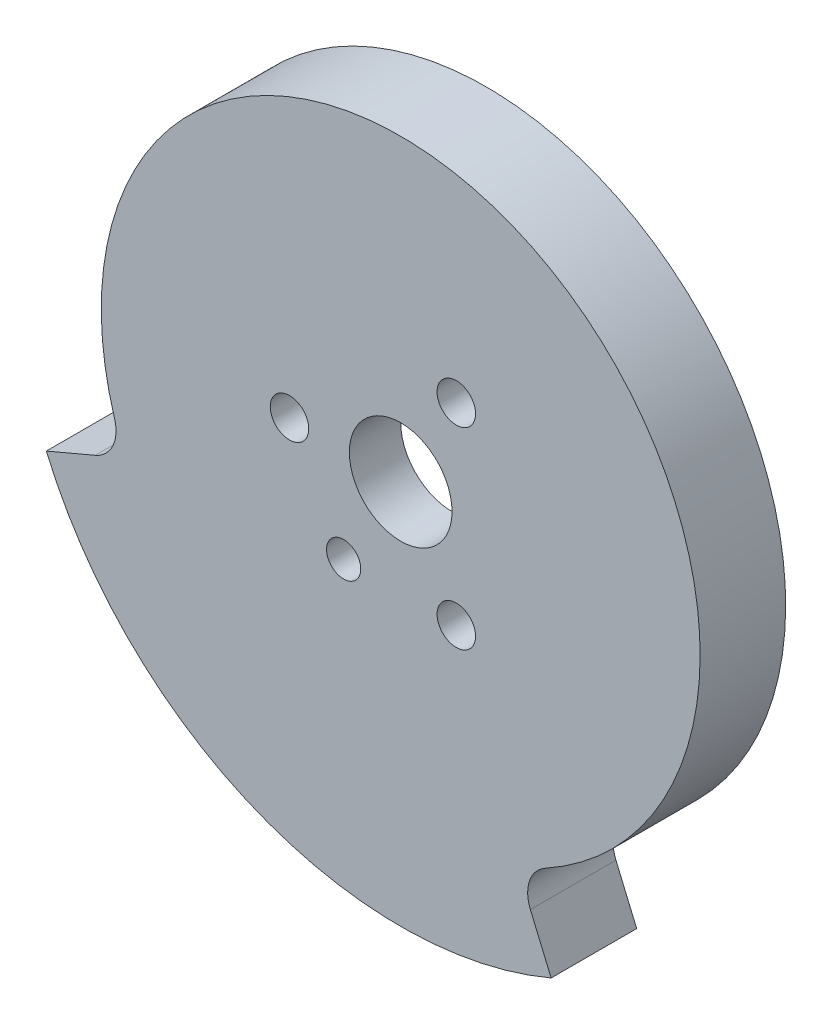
ISO-10303-21;
HEADER;
FILE_DESCRIPTION(('STEP AP214'),'2;1');
FILE_NAME('part.step','',(''),(''),'','','');
FILE_SCHEMA(('AUTOMOTIVE_DESIGN { 1 0 10303 214 1 1 1 1 }'));
ENDSEC;
DATA;
#1=APPLICATION_CONTEXT('core data for automotive mechanical design processes');
#2=APPLICATION_PROTOCOL_DEFINITION('international standard','automotive_design',2000,#1);
#3=PRODUCT_CONTEXT('',#1,'mechanical');
#4=PRODUCT('Part','Part','',(#3));
#5=PRODUCT_RELATED_PRODUCT_CATEGORY('part','',(#4));
#6=PRODUCT_DEFINITION_FORMATION('','',#4);
#7=PRODUCT_DEFINITION_CONTEXT('part definition',#1,'design');
#8=PRODUCT_DEFINITION('design','',#6,#7);
#9=PRODUCT_DEFINITION_SHAPE('','',#8);
#10=(LENGTH_UNIT() NAMED_UNIT(*) SI_UNIT(.MILLI.,.METRE.));
#11=(NAMED_UNIT(*) PLANE_ANGLE_UNIT() SI_UNIT($,.RADIAN.));
#12=(NAMED_UNIT(*) SI_UNIT($,.STERADIAN.) SOLID_ANGLE_UNIT());
#13=UNCERTAINTY_MEASURE_WITH_UNIT(LENGTH_MEASURE(1.E-05),#10,'distance_accuracy_value','');
#14=(GEOMETRIC_REPRESENTATION_CONTEXT(3) GLOBAL_UNCERTAINTY_ASSIGNED_CONTEXT((#13)) GLOBAL_UNIT_ASSIGNED_CONTEXT((#10,
#11,#12)) REPRESENTATION_CONTEXT('',''));
#15=CARTESIAN_POINT('',(0.,0.,0.));
#16=DIRECTION('',(0.,0.,1.));
#17=DIRECTION('',(1.,0.,0.));
#18=AXIS2_PLACEMENT_3D('',#15,#16,#17);
#19=CARTESIAN_POINT('',(-13.,0.,10.));
#20=DIRECTION('',(0.,0.,-1.));
#21=DIRECTION('',(-1.,0.,0.));
#22=AXIS2_PLACEMENT_3D('',#19,#20,#21);
#23=CYLINDRICAL_SURFACE('',#22,2.25);
#24=CARTESIAN_POINT('',(-13.,0.,10.));
#25=DIRECTION('',(0.,0.,1.));
#26=DIRECTION('',(1.,0.,0.));
#27=AXIS2_PLACEMENT_3D('',#24,#25,#26);
#28=CIRCLE('',#27,2.25);
#29=CARTESIAN_POINT('',(-10.75,0.,10.));
#30=VERTEX_POINT('',#29);
#31=EDGE_CURVE('E103',#30,#30,#28,.T.);
#32=ORIENTED_EDGE('',*,*,#31,.T.);
#33=EDGE_LOOP('',(#32));
#34=FACE_BOUND('',#33,.T.);
#35=CARTESIAN_POINT('',(-13.,0.,4.));
#36=DIRECTION('',(0.,0.,-1.));
#37=DIRECTION('',(-1.,0.,0.));
#38=AXIS2_PLACEMENT_3D('',#35,#36,#37);
#39=CIRCLE('',#38,2.25);
#40=CARTESIAN_POINT('',(-15.25,0.,4.));
#41=VERTEX_POINT('',#40);
#42=EDGE_CURVE('E201',#41,#41,#39,.T.);
#43=ORIENTED_EDGE('',*,*,#42,.T.);
#44=EDGE_LOOP('',(#43));
#45=FACE_BOUND('',#44,.T.);
#46=ADVANCED_FACE('F31',(#34,#45),#23,.F.);
#47=CARTESIAN_POINT('',(6.49999999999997,11.2583302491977,10.));
#48=DIRECTION('',(0.,0.,-1.));
#49=DIRECTION('',(-1.,0.,0.));
#50=AXIS2_PLACEMENT_3D('',#47,#48,#49);
#51=CYLINDRICAL_SURFACE('',#50,2.25);
#52=CARTESIAN_POINT('',(6.49999999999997,11.2583302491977,10.));
#53=DIRECTION('',(0.,0.,1.));
#54=DIRECTION('',(1.,0.,0.));
#55=AXIS2_PLACEMENT_3D('',#52,#53,#54);
#56=CIRCLE('',#55,2.25);
#57=CARTESIAN_POINT('',(8.74999999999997,11.2583302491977,10.));
#58=VERTEX_POINT('',#57);
#59=EDGE_CURVE('E106',#58,#58,#56,.T.);
#60=ORIENTED_EDGE('',*,*,#59,.T.);
#61=EDGE_LOOP('',(#60));
#62=FACE_BOUND('',#61,.T.);
#63=CARTESIAN_POINT('',(6.49999999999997,11.2583302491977,4.));
#64=DIRECTION('',(0.,0.,-1.));
#65=DIRECTION('',(-1.,0.,0.));
#66=AXIS2_PLACEMENT_3D('',#63,#64,#65);
#67=CIRCLE('',#66,2.25);
#68=CARTESIAN_POINT('',(4.24999999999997,11.2583302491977,4.));
#69=VERTEX_POINT('',#68);
#70=EDGE_CURVE('E204',#69,#69,#67,.T.);
#71=ORIENTED_EDGE('',*,*,#70,.T.);
#72=EDGE_LOOP('',(#71));
#73=FACE_BOUND('',#72,.T.);
#74=ADVANCED_FACE('F164',(#62,#73),#51,.F.);
#75=CARTESIAN_POINT('',(6.49999999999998,-11.2583302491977,10.));
#76=DIRECTION('',(0.,0.,-1.));
#77=DIRECTION('',(-1.,0.,0.));
#78=AXIS2_PLACEMENT_3D('',#75,#76,#77);
#79=CYLINDRICAL_SURFACE('',#78,2.25);
#80=CARTESIAN_POINT('',(6.49999999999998,-11.2583302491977,10.));
#81=DIRECTION('',(0.,0.,1.));
#82=DIRECTION('',(1.,0.,0.));
#83=AXIS2_PLACEMENT_3D('',#80,#81,#82);
#84=CIRCLE('',#83,2.25);
#85=CARTESIAN_POINT('',(8.74999999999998,-11.2583302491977,10.));
#86=VERTEX_POINT('',#85);
#87=EDGE_CURVE('E193',#86,#86,#84,.T.);
#88=ORIENTED_EDGE('',*,*,#87,.T.);
#89=EDGE_LOOP('',(#88));
#90=FACE_BOUND('',#89,.T.);
#91=CARTESIAN_POINT('',(6.49999999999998,-11.2583302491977,4.));
#92=DIRECTION('',(0.,0.,-1.));
#93=DIRECTION('',(-1.,0.,0.));
#94=AXIS2_PLACEMENT_3D('',#91,#92,#93);
#95=CIRCLE('',#94,2.25);
#96=CARTESIAN_POINT('',(4.24999999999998,-11.2583302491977,4.));
#97=VERTEX_POINT('',#96);
#98=EDGE_CURVE('E207',#97,#97,#95,.T.);
#99=ORIENTED_EDGE('',*,*,#98,.T.);
#100=EDGE_LOOP('',(#99));
#101=FACE_BOUND('',#100,.T.);
#102=ADVANCED_FACE('F170',(#90,#101),#79,.F.);
#103=CARTESIAN_POINT('',(0.,0.,10.));
#104=DIRECTION('',(0.,0.,-1.));
#105=DIRECTION('',(-1.,0.,0.));
#106=AXIS2_PLACEMENT_3D('',#103,#104,#105);
#107=CYLINDRICAL_SURFACE('',#106,6.);
#108=CARTESIAN_POINT('',(0.,0.,10.));
#109=DIRECTION('',(0.,0.,1.));
#110=DIRECTION('',(1.,0.,0.));
#111=AXIS2_PLACEMENT_3D('',#108,#109,#110);
#112=CIRCLE('',#111,6.);
#113=CARTESIAN_POINT('',(6.,0.,10.));
#114=VERTEX_POINT('',#113);
#115=EDGE_CURVE('E190',#114,#114,#112,.T.);
#116=ORIENTED_EDGE('',*,*,#115,.T.);
#117=EDGE_LOOP('',(#116));
#118=FACE_BOUND('',#117,.T.);
#119=CARTESIAN_POINT('',(0.,0.,4.));
#120=DIRECTION('',(0.,0.,-1.));
#121=DIRECTION('',(-1.,0.,0.));
#122=AXIS2_PLACEMENT_3D('',#119,#120,#121);
#123=CIRCLE('',#122,6.);
#124=CARTESIAN_POINT('',(-6.,0.,4.));
#125=VERTEX_POINT('',#124);
#126=EDGE_CURVE('E210',#125,#125,#123,.T.);
#127=ORIENTED_EDGE('',*,*,#126,.T.);
#128=EDGE_LOOP('',(#127));
#129=FACE_BOUND('',#128,.T.);
#130=ADVANCED_FACE('F184',(#118,#129),#107,.F.);
#131=CARTESIAN_POINT('',(-6.67012731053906,-11.1583780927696,10.));
#132=DIRECTION('',(0.,0.,-1.));
#133=DIRECTION('',(-1.,0.,0.));
#134=AXIS2_PLACEMENT_3D('',#131,#132,#133);
#135=CYLINDRICAL_SURFACE('',#134,2.);
#136=CARTESIAN_POINT('',(-6.67012731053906,-11.1583780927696,10.));
#137=DIRECTION('',(0.,0.,1.));
#138=DIRECTION('',(1.,0.,0.));
#139=AXIS2_PLACEMENT_3D('',#136,#137,#138);
#140=CIRCLE('',#139,2.);
#141=CARTESIAN_POINT('',(-4.67012731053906,-11.1583780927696,10.));
#142=VERTEX_POINT('',#141);
#143=EDGE_CURVE('E198',#142,#142,#140,.T.);
#144=ORIENTED_EDGE('',*,*,#143,.T.);
#145=EDGE_LOOP('',(#144));
#146=FACE_BOUND('',#145,.T.);
#147=CARTESIAN_POINT('',(-6.67012731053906,-11.1583780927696,4.));
#148=DIRECTION('',(0.,0.,-1.));
#149=DIRECTION('',(-1.,0.,0.));
#150=AXIS2_PLACEMENT_3D('',#147,#148,#149);
#151=CIRCLE('',#150,2.);
#152=CARTESIAN_POINT('',(-8.67012731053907,-11.1583780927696,4.));
#153=VERTEX_POINT('',#152);
#154=EDGE_CURVE('E35',#153,#153,#151,.T.);
#155=ORIENTED_EDGE('',*,*,#154,.T.);
#156=EDGE_LOOP('',(#155));
#157=FACE_BOUND('',#156,.T.);
#158=ADVANCED_FACE('F179',(#146,#157),#135,.F.);
#159=CARTESIAN_POINT('',(-37.2732930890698,-11.4761327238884,10.));
#160=DIRECTION('',(0.,0.,-1.));
#161=DIRECTION('',(-1.,0.,0.));
#162=AXIS2_PLACEMENT_3D('',#159,#160,#161);
#163=PLANE('',#162);
#164=ORIENTED_EDGE('',*,*,#115,.F.);
#165=EDGE_LOOP('',(#164));
#166=FACE_BOUND('',#165,.T.);
#167=ORIENTED_EDGE('',*,*,#59,.F.);
#168=EDGE_LOOP('',(#167));
#169=FACE_BOUND('',#168,.T.);
#170=CARTESIAN_POINT('',(-37.2732930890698,-11.4761327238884,10.));
#171=DIRECTION('',(0.,0.,-1.));
#172=DIRECTION('',(-1.,0.,0.));
#173=AXIS2_PLACEMENT_3D('',#170,#171,#172);
#174=CIRCLE('',#173,4.);
#175=CARTESIAN_POINT('',(-33.4503912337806,-10.2990934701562,10.));
#176=VERTEX_POINT('',#175);
#177=CARTESIAN_POINT('',(-35.7103685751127,-15.1581521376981,10.));
#178=VERTEX_POINT('',#177);
#179=EDGE_CURVE('E117',#176,#178,#174,.T.);
#180=ORIENTED_EDGE('',*,*,#179,.T.);
#181=DIRECTION('',(-0.920504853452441,-0.390731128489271,0.));
#182=VECTOR('',#181,1.);
#183=CARTESIAN_POINT('',(-35.7103685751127,-15.1581521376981,10.));
#184=LINE('',#183,#182);
#185=CARTESIAN_POINT('',(-41.4227184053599,-17.5829007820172,10.));
#186=VERTEX_POINT('',#185);
#187=EDGE_CURVE('E98',#178,#186,#184,.T.);
#188=ORIENTED_EDGE('',*,*,#187,.T.);
#189=CARTESIAN_POINT('',(0.,0.,10.));
#190=DIRECTION('',(0.,0.,1.));
#191=DIRECTION('',(1.,0.,0.));
#192=AXIS2_PLACEMENT_3D('',#189,#190,#191);
#193=CIRCLE('',#192,45.);
#194=CARTESIAN_POINT('',(17.5829007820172,-41.4227184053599,10.));
#195=VERTEX_POINT('',#194);
#196=EDGE_CURVE('E120',#186,#195,#193,.T.);
#197=ORIENTED_EDGE('',*,*,#196,.T.);
#198=DIRECTION('',(-0.390731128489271,0.920504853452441,0.));
#199=VECTOR('',#198,1.);
#200=CARTESIAN_POINT('',(15.1581521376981,-35.7103685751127,10.));
#201=LINE('',#200,#199);
#202=CARTESIAN_POINT('',(15.1581521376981,-35.7103685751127,10.));
#203=VERTEX_POINT('',#202);
#204=EDGE_CURVE('E122',#195,#203,#201,.T.);
#205=ORIENTED_EDGE('',*,*,#204,.T.);
#206=CARTESIAN_POINT('',(18.8401715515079,-34.1474440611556,10.));
#207=DIRECTION('',(0.,0.,-1.));
#208=DIRECTION('',(1.,0.,0.));
#209=AXIS2_PLACEMENT_3D('',#206,#207,#208);
#210=CIRCLE('',#209,4.);
#211=CARTESIAN_POINT('',(16.9078462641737,-30.6451421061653,10.));
#212=VERTEX_POINT('',#211);
#213=EDGE_CURVE('E52',#203,#212,#210,.T.);
#214=ORIENTED_EDGE('',*,*,#213,.T.);
#215=CARTESIAN_POINT('',(0.,0.,10.));
#216=DIRECTION('',(0.,0.,1.));
#217=DIRECTION('',(1.,0.,0.));
#218=AXIS2_PLACEMENT_3D('',#215,#216,#217);
#219=CIRCLE('',#218,35.);
#220=EDGE_CURVE('E47',#212,#176,#219,.T.);
#221=ORIENTED_EDGE('',*,*,#220,.T.);
#222=EDGE_LOOP('',(#180,#188,#197,#205,#214,#221));
#223=FACE_BOUND('',#222,.T.);
#224=ORIENTED_EDGE('',*,*,#31,.F.);
#225=EDGE_LOOP('',(#224));
#226=FACE_BOUND('',#225,.T.);
#227=ORIENTED_EDGE('',*,*,#87,.F.);
#228=EDGE_LOOP('',(#227));
#229=FACE_BOUND('',#228,.T.);
#230=ORIENTED_EDGE('',*,*,#143,.F.);
#231=EDGE_LOOP('',(#230));
#232=FACE_BOUND('',#231,.T.);
#233=ADVANCED_FACE('F141',(#166,#169,#223,#226,#229,#232),#163,.F.);
#234=CARTESIAN_POINT('',(-37.2732930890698,-11.4761327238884,0.));
#235=DIRECTION('',(0.,0.,-1.));
#236=DIRECTION('',(-1.,0.,0.));
#237=AXIS2_PLACEMENT_3D('',#234,#235,#236);
#238=PLANE('',#237);
#239=CARTESIAN_POINT('',(0.,0.,0.));
#240=DIRECTION('',(0.,0.,-1.));
#241=DIRECTION('',(-1.,0.,0.));
#242=AXIS2_PLACEMENT_3D('',#239,#240,#241);
#243=CIRCLE('',#242,25.);
#244=CARTESIAN_POINT('',(-25.,0.,0.));
#245=VERTEX_POINT('',#244);
#246=EDGE_CURVE('E216',#245,#245,#243,.T.);
#247=ORIENTED_EDGE('',*,*,#246,.F.);
#248=EDGE_LOOP('',(#247));
#249=FACE_BOUND('',#248,.T.);
#250=CARTESIAN_POINT('',(-37.2732930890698,-11.4761327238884,0.));
#251=DIRECTION('',(0.,0.,-1.));
#252=DIRECTION('',(-1.,0.,0.));
#253=AXIS2_PLACEMENT_3D('',#250,#251,#252);
#254=CIRCLE('',#253,4.);
#255=CARTESIAN_POINT('',(-33.4503912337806,-10.2990934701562,0.));
#256=VERTEX_POINT('',#255);
#257=CARTESIAN_POINT('',(-35.7103685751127,-15.1581521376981,0.));
#258=VERTEX_POINT('',#257);
#259=EDGE_CURVE('E89',#256,#258,#254,.T.);
#260=ORIENTED_EDGE('',*,*,#259,.F.);
#261=CARTESIAN_POINT('',(0.,0.,0.));
#262=DIRECTION('',(0.,0.,1.));
#263=DIRECTION('',(1.,0.,0.));
#264=AXIS2_PLACEMENT_3D('',#261,#262,#263);
#265=CIRCLE('',#264,35.);
#266=CARTESIAN_POINT('',(16.9078462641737,-30.6451421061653,0.));
#267=VERTEX_POINT('',#266);
#268=EDGE_CURVE('E115',#267,#256,#265,.T.);
#269=ORIENTED_EDGE('',*,*,#268,.F.);
#270=CARTESIAN_POINT('',(18.8401715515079,-34.1474440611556,0.));
#271=DIRECTION('',(0.,0.,-1.));
#272=DIRECTION('',(1.,0.,0.));
#273=AXIS2_PLACEMENT_3D('',#270,#271,#272);
#274=CIRCLE('',#273,4.);
#275=CARTESIAN_POINT('',(15.1581521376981,-35.7103685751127,0.));
#276=VERTEX_POINT('',#275);
#277=EDGE_CURVE('E113',#276,#267,#274,.T.);
#278=ORIENTED_EDGE('',*,*,#277,.F.);
#279=DIRECTION('',(-0.390731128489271,0.920504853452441,0.));
#280=VECTOR('',#279,1.);
#281=CARTESIAN_POINT('',(15.1581521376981,-35.7103685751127,0.));
#282=LINE('',#281,#280);
#283=CARTESIAN_POINT('',(17.5829007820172,-41.4227184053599,0.));
#284=VERTEX_POINT('',#283);
#285=EDGE_CURVE('E111',#284,#276,#282,.T.);
#286=ORIENTED_EDGE('',*,*,#285,.F.);
#287=CARTESIAN_POINT('',(0.,0.,0.));
#288=DIRECTION('',(0.,0.,1.));
#289=DIRECTION('',(1.,0.,0.));
#290=AXIS2_PLACEMENT_3D('',#287,#288,#289);
#291=CIRCLE('',#290,45.);
#292=CARTESIAN_POINT('',(-41.4227184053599,-17.5829007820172,0.));
#293=VERTEX_POINT('',#292);
#294=EDGE_CURVE('E91',#293,#284,#291,.T.);
#295=ORIENTED_EDGE('',*,*,#294,.F.);
#296=DIRECTION('',(-0.920504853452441,-0.390731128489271,0.));
#297=VECTOR('',#296,1.);
#298=CARTESIAN_POINT('',(-35.7103685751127,-15.1581521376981,0.));
#299=LINE('',#298,#297);
#300=EDGE_CURVE('E85',#258,#293,#299,.T.);
#301=ORIENTED_EDGE('',*,*,#300,.F.);
#302=EDGE_LOOP('',(#260,#269,#278,#286,#295,#301));
#303=FACE_BOUND('',#302,.T.);
#304=ADVANCED_FACE('F86',(#249,#303),#238,.T.);
#305=CARTESIAN_POINT('',(-37.2732930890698,-11.4761327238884,10.));
#306=DIRECTION('',(0.,0.,-1.));
#307=DIRECTION('',(-1.,0.,0.));
#308=AXIS2_PLACEMENT_3D('',#305,#306,#307);
#309=CYLINDRICAL_SURFACE('',#308,4.);
#310=ORIENTED_EDGE('',*,*,#259,.T.);
#311=DIRECTION('',(0.,0.,-1.));
#312=VECTOR('',#311,1.);
#313=CARTESIAN_POINT('',(-35.7103685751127,-15.1581521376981,10.));
#314=LINE('',#313,#312);
#315=EDGE_CURVE('E11',#178,#258,#314,.T.);
#316=ORIENTED_EDGE('',*,*,#315,.F.);
#317=ORIENTED_EDGE('',*,*,#179,.F.);
#318=DIRECTION('',(0.,0.,-1.));
#319=VECTOR('',#318,1.);
#320=CARTESIAN_POINT('',(-33.4503912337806,-10.2990934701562,10.));
#321=LINE('',#320,#319);
#322=EDGE_CURVE('E102',#176,#256,#321,.T.);
#323=ORIENTED_EDGE('',*,*,#322,.T.);
#324=EDGE_LOOP('',(#310,#316,#317,#323));
#325=FACE_BOUND('',#324,.T.);
#326=ADVANCED_FACE('F33',(#325),#309,.F.);
#327=CARTESIAN_POINT('',(-35.7103685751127,-15.1581521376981,10.));
#328=DIRECTION('',(0.390731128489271,-0.920504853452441,0.));
#329=DIRECTION('',(0.920504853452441,0.390731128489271,0.));
#330=AXIS2_PLACEMENT_3D('',#327,#328,#329);
#331=PLANE('',#330);
#332=ORIENTED_EDGE('',*,*,#300,.T.);
#333=DIRECTION('',(0.,0.,-1.));
#334=VECTOR('',#333,1.);
#335=CARTESIAN_POINT('',(-41.4227184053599,-17.5829007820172,10.));
#336=LINE('',#335,#334);
#337=EDGE_CURVE('E40',#186,#293,#336,.T.);
#338=ORIENTED_EDGE('',*,*,#337,.F.);
#339=ORIENTED_EDGE('',*,*,#187,.F.);
#340=ORIENTED_EDGE('',*,*,#315,.T.);
#341=EDGE_LOOP('',(#332,#338,#339,#340));
#342=FACE_BOUND('',#341,.T.);
#343=ADVANCED_FACE('F97',(#342),#331,.F.);
#344=CARTESIAN_POINT('',(0.,0.,10.));
#345=DIRECTION('',(0.,0.,-1.));
#346=DIRECTION('',(-1.,0.,0.));
#347=AXIS2_PLACEMENT_3D('',#344,#345,#346);
#348=CYLINDRICAL_SURFACE('',#347,45.);
#349=ORIENTED_EDGE('',*,*,#294,.T.);
#350=DIRECTION('',(0.,0.,-1.));
#351=VECTOR('',#350,1.);
#352=CARTESIAN_POINT('',(17.5829007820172,-41.4227184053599,10.));
#353=LINE('',#352,#351);
#354=EDGE_CURVE('E133',#195,#284,#353,.T.);
#355=ORIENTED_EDGE('',*,*,#354,.F.);
#356=ORIENTED_EDGE('',*,*,#196,.F.);
#357=ORIENTED_EDGE('',*,*,#337,.T.);
#358=EDGE_LOOP('',(#349,#355,#356,#357));
#359=FACE_BOUND('',#358,.T.);
#360=ADVANCED_FACE('F138',(#359),#348,.T.);
#361=CARTESIAN_POINT('',(15.1581521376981,-35.7103685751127,10.));
#362=DIRECTION('',(-0.920504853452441,-0.390731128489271,0.));
#363=DIRECTION('',(0.390731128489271,-0.920504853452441,0.));
#364=AXIS2_PLACEMENT_3D('',#361,#362,#363);
#365=PLANE('',#364);
#366=ORIENTED_EDGE('',*,*,#285,.T.);
#367=DIRECTION('',(0.,0.,-1.));
#368=VECTOR('',#367,1.);
#369=CARTESIAN_POINT('',(15.1581521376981,-35.7103685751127,10.));
#370=LINE('',#369,#368);
#371=EDGE_CURVE('E130',#203,#276,#370,.T.);
#372=ORIENTED_EDGE('',*,*,#371,.F.);
#373=ORIENTED_EDGE('',*,*,#204,.F.);
#374=ORIENTED_EDGE('',*,*,#354,.T.);
#375=EDGE_LOOP('',(#366,#372,#373,#374));
#376=FACE_BOUND('',#375,.T.);
#377=ADVANCED_FACE('F145',(#376),#365,.F.);
#378=CARTESIAN_POINT('',(18.8401715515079,-34.1474440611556,10.));
#379=DIRECTION('',(0.,0.,-1.));
#380=DIRECTION('',(-1.,0.,0.));
#381=AXIS2_PLACEMENT_3D('',#378,#379,#380);
#382=CYLINDRICAL_SURFACE('',#381,4.);
#383=ORIENTED_EDGE('',*,*,#277,.T.);
#384=DIRECTION('',(0.,0.,-1.));
#385=VECTOR('',#384,1.);
#386=CARTESIAN_POINT('',(16.9078462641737,-30.6451421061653,10.));
#387=LINE('',#386,#385);
#388=EDGE_CURVE('E127',#212,#267,#387,.T.);
#389=ORIENTED_EDGE('',*,*,#388,.F.);
#390=ORIENTED_EDGE('',*,*,#213,.F.);
#391=ORIENTED_EDGE('',*,*,#371,.T.);
#392=EDGE_LOOP('',(#383,#389,#390,#391));
#393=FACE_BOUND('',#392,.T.);
#394=ADVANCED_FACE('F148',(#393),#382,.F.);
#395=CARTESIAN_POINT('',(0.,0.,10.));
#396=DIRECTION('',(0.,0.,-1.));
#397=DIRECTION('',(-1.,0.,0.));
#398=AXIS2_PLACEMENT_3D('',#395,#396,#397);
#399=CYLINDRICAL_SURFACE('',#398,35.);
#400=ORIENTED_EDGE('',*,*,#268,.T.);
#401=ORIENTED_EDGE('',*,*,#322,.F.);
#402=ORIENTED_EDGE('',*,*,#220,.F.);
#403=ORIENTED_EDGE('',*,*,#388,.T.);
#404=EDGE_LOOP('',(#400,#401,#402,#403));
#405=FACE_BOUND('',#404,.T.);
#406=ADVANCED_FACE('F150',(#405),#399,.T.);
#407=CARTESIAN_POINT('',(0.,0.,4.));
#408=DIRECTION('',(0.,0.,-1.));
#409=DIRECTION('',(-1.,0.,0.));
#410=AXIS2_PLACEMENT_3D('',#407,#408,#409);
#411=CYLINDRICAL_SURFACE('',#410,25.);
#412=CARTESIAN_POINT('',(0.,0.,4.));
#413=DIRECTION('',(0.,0.,-1.));
#414=DIRECTION('',(-1.,0.,0.));
#415=AXIS2_PLACEMENT_3D('',#412,#413,#414);
#416=CIRCLE('',#415,25.);
#417=CARTESIAN_POINT('',(-25.,0.,4.));
#418=VERTEX_POINT('',#417);
#419=EDGE_CURVE('E213',#418,#418,#416,.T.);
#420=ORIENTED_EDGE('',*,*,#419,.F.);
#421=EDGE_LOOP('',(#420));
#422=FACE_BOUND('',#421,.T.);
#423=ORIENTED_EDGE('',*,*,#246,.T.);
#424=EDGE_LOOP('',(#423));
#425=FACE_BOUND('',#424,.T.);
#426=ADVANCED_FACE('F152',(#422,#425),#411,.F.);
#427=CARTESIAN_POINT('',(0.,0.,4.));
#428=DIRECTION('',(0.,0.,-1.));
#429=DIRECTION('',(-1.,0.,0.));
#430=AXIS2_PLACEMENT_3D('',#427,#428,#429);
#431=PLANE('',#430);
#432=ORIENTED_EDGE('',*,*,#42,.F.);
#433=EDGE_LOOP('',(#432));
#434=FACE_BOUND('',#433,.T.);
#435=ORIENTED_EDGE('',*,*,#70,.F.);
#436=EDGE_LOOP('',(#435));
#437=FACE_BOUND('',#436,.T.);
#438=ORIENTED_EDGE('',*,*,#98,.F.);
#439=EDGE_LOOP('',(#438));
#440=FACE_BOUND('',#439,.T.);
#441=ORIENTED_EDGE('',*,*,#126,.F.);
#442=EDGE_LOOP('',(#441));
#443=FACE_BOUND('',#442,.T.);
#444=ORIENTED_EDGE('',*,*,#154,.F.);
#445=EDGE_LOOP('',(#444));
#446=FACE_BOUND('',#445,.T.);
#447=ORIENTED_EDGE('',*,*,#419,.T.);
#448=EDGE_LOOP('',(#447));
#449=FACE_BOUND('',#448,.T.);
#450=ADVANCED_FACE('F158',(#434,#437,#440,#443,#446,#449),#431,.T.);
#451=CLOSED_SHELL('',(#46,#74,#102,#130,#158,#233,#304,#326,#343,#360,#377,#394,#406,#426,#450));
#452=MANIFOLD_SOLID_BREP('B2',#451);
#453=ADVANCED_BREP_SHAPE_REPRESENTATION('',(#18,#452),#14);
#454=SHAPE_DEFINITION_REPRESENTATION(#9,#453);
ENDSEC;
END-ISO-10303-21;
